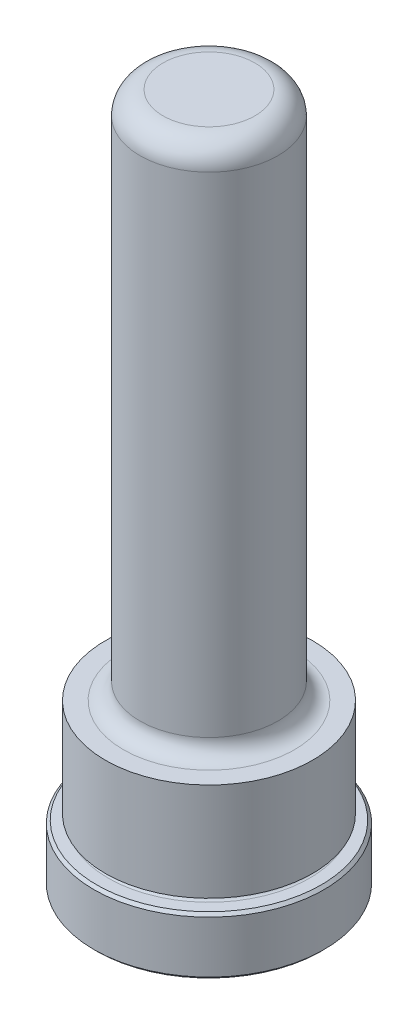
from build123d import *

# Parameters (mm, degrees)
CHAMFER1_SIZE = 0.381
FILLET1_R     = 3.175


with BuildPart() as part:
    # Sketch1 → Revolve1 (revolve)
    with BuildSketch(Plane(origin=(0, 0, 0), x_dir=(0, 0, -1), z_dir=(1, 0, 0)), mode=Mode.PRIVATE) as revolve1_sk:
        with BuildLine():
            Line((0, 0), (15.875, 0))
            Line((15.875, 0), (15.875, 7.9248))
            Line((15.875, 7.9248), (13.8938, 7.9248))
            ThreePointArc((13.8938, 7.9248), (13.5128, 8.3058), (13.8938, 8.6868))
            Line((13.8938, 8.6868), (14.3002, 8.6868))
            Line((14.3002, 8.6868), (14.3002, 22.225))
            Line((14.3002, 22.225), (11.7983, 22.225))
            ThreePointArc((11.7983, 22.225), (10.181853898, 22.894553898), (9.5123, 24.511))
            Line((9.5123, 24.511), (9.5123, 95.25))
            Line((9.5123, 95.25), (0, 95.25))
            Line((0, 95.25), (0, 0))
        make_face()
    revolve(revolve1_sk.sketch.rotate(Axis((0, 0, 0), (0, -1, 0)), 180), axis=Axis((0, 0, 0), (0, -1, 0)))

    # Chamfer1
    chamfer1_edges = [part.edges().sort_by_distance(p)[0] for p in [
        (0, 7.9248, -15.875),
        (0, 0, -15.875),
    ]]
    chamfer(chamfer1_edges, length=CHAMFER1_SIZE)

    # Fillet1
    fillet1_edges = [part.edges().sort_by_distance(p)[0] for p in [
        (0, 95.25, -9.5123),
    ]]
    fillet(fillet1_edges, radius=FILLET1_R)


solid = part.part
